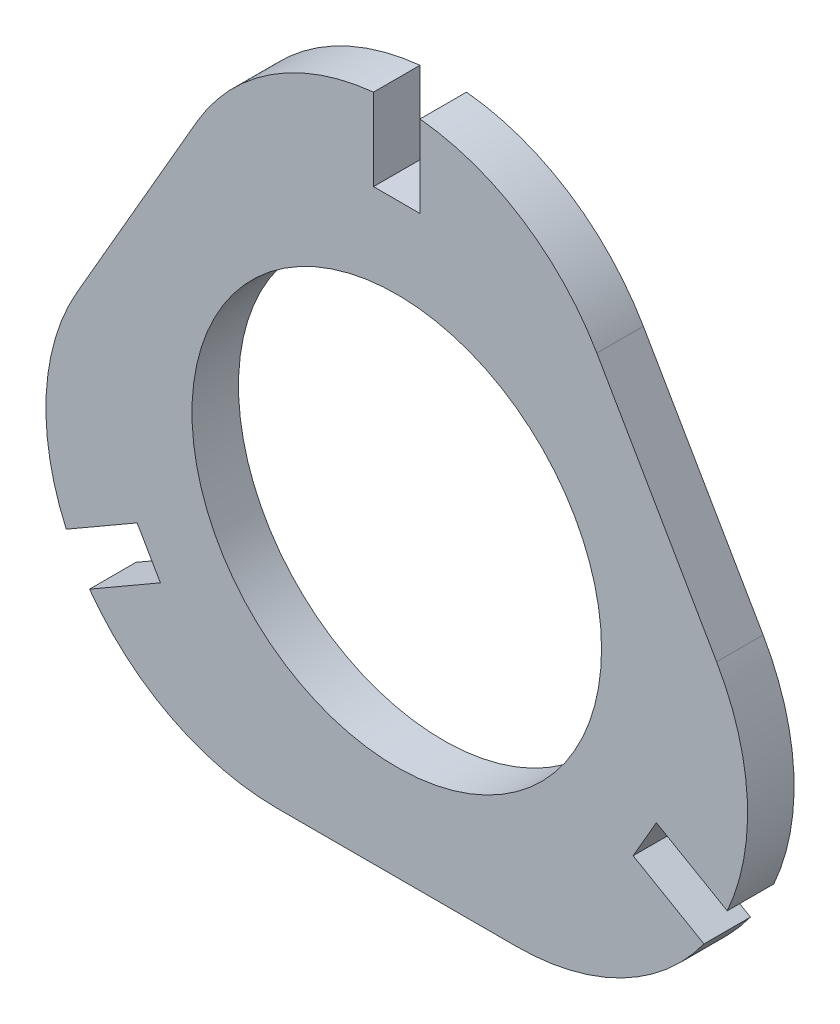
ISO-10303-21;
HEADER;
FILE_DESCRIPTION(('STEP AP214'),'2;1');
FILE_NAME('part.step','',(''),(''),'','','');
FILE_SCHEMA(('AUTOMOTIVE_DESIGN { 1 0 10303 214 1 1 1 1 }'));
ENDSEC;
DATA;
#1=APPLICATION_CONTEXT('core data for automotive mechanical design processes');
#2=APPLICATION_PROTOCOL_DEFINITION('international standard','automotive_design',2000,#1);
#3=PRODUCT_CONTEXT('',#1,'mechanical');
#4=PRODUCT('Part','Part','',(#3));
#5=PRODUCT_RELATED_PRODUCT_CATEGORY('part','',(#4));
#6=PRODUCT_DEFINITION_FORMATION('','',#4);
#7=PRODUCT_DEFINITION_CONTEXT('part definition',#1,'design');
#8=PRODUCT_DEFINITION('design','',#6,#7);
#9=PRODUCT_DEFINITION_SHAPE('','',#8);
#10=(LENGTH_UNIT() NAMED_UNIT(*) SI_UNIT(.MILLI.,.METRE.));
#11=(NAMED_UNIT(*) PLANE_ANGLE_UNIT() SI_UNIT($,.RADIAN.));
#12=(NAMED_UNIT(*) SI_UNIT($,.STERADIAN.) SOLID_ANGLE_UNIT());
#13=UNCERTAINTY_MEASURE_WITH_UNIT(LENGTH_MEASURE(1.E-05),#10,'distance_accuracy_value','');
#14=(GEOMETRIC_REPRESENTATION_CONTEXT(3) GLOBAL_UNCERTAINTY_ASSIGNED_CONTEXT((#13)) GLOBAL_UNIT_ASSIGNED_CONTEXT((#10,
#11,#12)) REPRESENTATION_CONTEXT('',''));
#15=CARTESIAN_POINT('',(0.,0.,0.));
#16=DIRECTION('',(0.,0.,1.));
#17=DIRECTION('',(1.,0.,0.));
#18=AXIS2_PLACEMENT_3D('',#15,#16,#17);
#19=CARTESIAN_POINT('',(-10.3034488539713,-5.94869896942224,0.));
#20=DIRECTION('',(0.,0.,1.));
#21=DIRECTION('',(1.,0.,0.));
#22=AXIS2_PLACEMENT_3D('',#19,#20,#21);
#23=CYLINDRICAL_SURFACE('',#22,19.875);
#24=DIRECTION('',(0.,0.,1.));
#25=VECTOR('',#24,1.);
#26=CARTESIAN_POINT('',(-26.4283348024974,-17.5678072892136,0.));
#27=LINE('',#26,#25);
#28=CARTESIAN_POINT('',(-26.4283348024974,-17.5678072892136,0.));
#29=VERTEX_POINT('',#28);
#30=CARTESIAN_POINT('',(-26.4283348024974,-17.5678072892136,4.));
#31=VERTEX_POINT('',#30);
#32=EDGE_CURVE('E354',#29,#31,#27,.T.);
#33=ORIENTED_EDGE('',*,*,#32,.F.);
#34=CARTESIAN_POINT('',(-10.3034488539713,-5.94869896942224,0.));
#35=DIRECTION('',(0.,0.,-1.));
#36=DIRECTION('',(-1.,0.,0.));
#37=AXIS2_PLACEMENT_3D('',#34,#35,#36);
#38=CIRCLE('',#37,19.875);
#39=CARTESIAN_POINT('',(-10.303448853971,-25.8236989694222,0.));
#40=VERTEX_POINT('',#39);
#41=EDGE_CURVE('E222',#29,#40,#38,.F.);
#42=ORIENTED_EDGE('',*,*,#41,.T.);
#43=DIRECTION('',(0.,0.,1.));
#44=VECTOR('',#43,1.);
#45=CARTESIAN_POINT('',(-10.303448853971,-25.8236989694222,0.));
#46=LINE('',#45,#44);
#47=CARTESIAN_POINT('',(-10.3034488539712,-25.8236989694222,4.));
#48=VERTEX_POINT('',#47);
#49=EDGE_CURVE('E218',#40,#48,#46,.T.);
#50=ORIENTED_EDGE('',*,*,#49,.T.);
#51=CARTESIAN_POINT('',(-10.3034488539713,-5.94869896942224,4.));
#52=DIRECTION('',(0.,0.,1.));
#53=DIRECTION('',(1.,0.,0.));
#54=AXIS2_PLACEMENT_3D('',#51,#52,#53);
#55=CIRCLE('',#54,19.875);
#56=EDGE_CURVE('E204',#31,#48,#55,.T.);
#57=ORIENTED_EDGE('',*,*,#56,.F.);
#58=EDGE_LOOP('',(#33,#42,#50,#57));
#59=FACE_BOUND('',#58,.T.);
#60=ADVANCED_FACE('F37',(#59),#23,.T.);
#61=CARTESIAN_POINT('',(10.3034488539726,-5.94869896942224,0.));
#62=DIRECTION('',(0.,0.,1.));
#63=DIRECTION('',(1.,0.,0.));
#64=AXIS2_PLACEMENT_3D('',#61,#62,#63);
#65=CYLINDRICAL_SURFACE('',#64,19.875);
#66=CARTESIAN_POINT('',(10.3034488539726,-5.94869896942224,4.));
#67=DIRECTION('',(0.,0.,1.));
#68=DIRECTION('',(1.,0.,0.));
#69=AXIS2_PLACEMENT_3D('',#66,#67,#68);
#70=CIRCLE('',#69,19.875);
#71=CARTESIAN_POINT('',(27.5157037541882,3.98880103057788,4.));
#72=VERTEX_POINT('',#71);
#73=CARTESIAN_POINT('',(28.4283348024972,-14.1037056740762,4.));
#74=VERTEX_POINT('',#73);
#75=EDGE_CURVE('E188',#72,#74,#70,.F.);
#76=ORIENTED_EDGE('',*,*,#75,.T.);
#77=DIRECTION('',(0.,0.,1.));
#78=VECTOR('',#77,1.);
#79=CARTESIAN_POINT('',(28.4283348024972,-14.1037056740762,0.));
#80=LINE('',#79,#78);
#81=CARTESIAN_POINT('',(28.4283348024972,-14.1037056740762,0.));
#82=VERTEX_POINT('',#81);
#83=EDGE_CURVE('E375',#82,#74,#80,.T.);
#84=ORIENTED_EDGE('',*,*,#83,.F.);
#85=CARTESIAN_POINT('',(10.3034488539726,-5.94869896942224,0.));
#86=DIRECTION('',(0.,0.,-1.));
#87=DIRECTION('',(-1.,0.,0.));
#88=AXIS2_PLACEMENT_3D('',#85,#86,#87);
#89=CIRCLE('',#88,19.875);
#90=CARTESIAN_POINT('',(27.5157037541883,3.98880103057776,0.));
#91=VERTEX_POINT('',#90);
#92=EDGE_CURVE('E212',#91,#82,#89,.T.);
#93=ORIENTED_EDGE('',*,*,#92,.F.);
#94=DIRECTION('',(0.,0.,1.));
#95=VECTOR('',#94,1.);
#96=CARTESIAN_POINT('',(27.5157037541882,3.988801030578,0.));
#97=LINE('',#96,#95);
#98=EDGE_CURVE('E192',#91,#72,#97,.T.);
#99=ORIENTED_EDGE('',*,*,#98,.T.);
#100=EDGE_LOOP('',(#76,#84,#93,#99));
#101=FACE_BOUND('',#100,.T.);
#102=ADVANCED_FACE('F311',(#101),#65,.T.);
#103=CARTESIAN_POINT('',(6.39169330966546E-13,11.8973979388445,0.));
#104=DIRECTION('',(0.,0.,1.));
#105=DIRECTION('',(1.,0.,0.));
#106=AXIS2_PLACEMENT_3D('',#103,#104,#105);
#107=CYLINDRICAL_SURFACE('',#106,19.875);
#108=DIRECTION('',(0.,0.,1.));
#109=VECTOR('',#108,1.);
#110=CARTESIAN_POINT('',(-2.,31.6715129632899,0.));
#111=LINE('',#110,#109);
#112=CARTESIAN_POINT('',(-2.,31.6715129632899,0.));
#113=VERTEX_POINT('',#112);
#114=CARTESIAN_POINT('',(-2.,31.6715129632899,4.));
#115=VERTEX_POINT('',#114);
#116=EDGE_CURVE('E255',#113,#115,#111,.T.);
#117=ORIENTED_EDGE('',*,*,#116,.F.);
#118=CARTESIAN_POINT('',(6.39169330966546E-13,11.8973979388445,0.));
#119=DIRECTION('',(0.,0.,-1.));
#120=DIRECTION('',(-1.,0.,0.));
#121=AXIS2_PLACEMENT_3D('',#118,#119,#120);
#122=CIRCLE('',#121,19.875);
#123=CARTESIAN_POINT('',(-17.2122549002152,21.8348979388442,0.));
#124=VERTEX_POINT('',#123);
#125=EDGE_CURVE('E237',#113,#124,#122,.F.);
#126=ORIENTED_EDGE('',*,*,#125,.T.);
#127=DIRECTION('',(0.,0.,1.));
#128=VECTOR('',#127,1.);
#129=CARTESIAN_POINT('',(-17.2122549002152,21.8348979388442,0.));
#130=LINE('',#129,#128);
#131=CARTESIAN_POINT('',(-17.2122549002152,21.8348979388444,4.));
#132=VERTEX_POINT('',#131);
#133=EDGE_CURVE('E233',#124,#132,#130,.T.);
#134=ORIENTED_EDGE('',*,*,#133,.T.);
#135=CARTESIAN_POINT('',(6.39169330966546E-13,11.8973979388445,4.));
#136=DIRECTION('',(0.,0.,1.));
#137=DIRECTION('',(1.,0.,0.));
#138=AXIS2_PLACEMENT_3D('',#135,#136,#137);
#139=CIRCLE('',#138,19.875);
#140=EDGE_CURVE('E208',#115,#132,#139,.T.);
#141=ORIENTED_EDGE('',*,*,#140,.F.);
#142=EDGE_LOOP('',(#117,#126,#134,#141));
#143=FACE_BOUND('',#142,.T.);
#144=ADVANCED_FACE('F279',(#143),#107,.T.);
#145=CARTESIAN_POINT('',(0.,0.,0.));
#146=DIRECTION('',(0.,0.,1.));
#147=DIRECTION('',(1.,0.,0.));
#148=AXIS2_PLACEMENT_3D('',#145,#146,#147);
#149=PLANE('',#148);
#150=CARTESIAN_POINT('',(0.,0.,0.));
#151=DIRECTION('',(0.,0.,1.));
#152=DIRECTION('',(1.,0.,0.));
#153=AXIS2_PLACEMENT_3D('',#150,#151,#152);
#154=CIRCLE('',#153,17.6153656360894);
#155=CARTESIAN_POINT('',(17.6153656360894,0.,0.));
#156=VERTEX_POINT('',#155);
#157=EDGE_CURVE('E236',#156,#156,#154,.T.);
#158=ORIENTED_EDGE('',*,*,#157,.T.);
#159=EDGE_LOOP('',(#158));
#160=FACE_BOUND('',#159,.T.);
#161=ORIENTED_EDGE('',*,*,#92,.T.);
#162=DIRECTION('',(-0.866025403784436,0.500000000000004,0.));
#163=VECTOR('',#162,1.);
#164=CARTESIAN_POINT('',(1.00000000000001,1.73205080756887,0.));
#165=LINE('',#164,#163);
#166=CARTESIAN_POINT('',(22.3314023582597,-10.5836400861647,0.));
#167=VERTEX_POINT('',#166);
#168=EDGE_CURVE('E282',#82,#167,#165,.T.);
#169=ORIENTED_EDGE('',*,*,#168,.T.);
#170=DIRECTION('',(-0.500000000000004,-0.866025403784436,0.));
#171=VECTOR('',#170,1.);
#172=CARTESIAN_POINT('',(21.3314023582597,-12.3156908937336,0.));
#173=LINE('',#172,#171);
#174=CARTESIAN_POINT('',(20.3314023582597,-14.0477417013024,0.));
#175=VERTEX_POINT('',#174);
#176=EDGE_CURVE('E367',#167,#175,#173,.T.);
#177=ORIENTED_EDGE('',*,*,#176,.T.);
#178=DIRECTION('',(0.866025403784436,-0.500000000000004,0.));
#179=VECTOR('',#178,1.);
#180=CARTESIAN_POINT('',(-1.00000000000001,-1.73205080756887,0.));
#181=LINE('',#180,#179);
#182=CARTESIAN_POINT('',(26.4283348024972,-17.567807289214,0.));
#183=VERTEX_POINT('',#182);
#184=EDGE_CURVE('E180',#175,#183,#181,.T.);
#185=ORIENTED_EDGE('',*,*,#184,.T.);
#186=CARTESIAN_POINT('',(10.3034488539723,-25.8236989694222,0.));
#187=VERTEX_POINT('',#186);
#188=EDGE_CURVE('E179',#183,#187,#89,.T.);
#189=ORIENTED_EDGE('',*,*,#188,.T.);
#190=DIRECTION('',(1.,0.,0.));
#191=VECTOR('',#190,1.);
#192=CARTESIAN_POINT('',(10.3034488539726,-25.8236989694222,0.));
#193=LINE('',#192,#191);
#194=EDGE_CURVE('E193',#40,#187,#193,.T.);
#195=ORIENTED_EDGE('',*,*,#194,.F.);
#196=ORIENTED_EDGE('',*,*,#41,.F.);
#197=DIRECTION('',(0.866025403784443,0.499999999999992,0.));
#198=VECTOR('',#197,1.);
#199=CARTESIAN_POINT('',(0.999999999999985,-1.73205080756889,0.));
#200=LINE('',#199,#198);
#201=CARTESIAN_POINT('',(-20.3314023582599,-14.0477417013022,0.));
#202=VERTEX_POINT('',#201);
#203=EDGE_CURVE('E171',#29,#202,#200,.T.);
#204=ORIENTED_EDGE('',*,*,#203,.T.);
#205=DIRECTION('',(-0.499999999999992,0.866025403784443,0.));
#206=VECTOR('',#205,1.);
#207=CARTESIAN_POINT('',(-21.3314023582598,-12.3156908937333,0.));
#208=LINE('',#207,#206);
#209=CARTESIAN_POINT('',(-22.3314023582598,-10.5836400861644,0.));
#210=VERTEX_POINT('',#209);
#211=EDGE_CURVE('E351',#202,#210,#208,.T.);
#212=ORIENTED_EDGE('',*,*,#211,.T.);
#213=DIRECTION('',(-0.866025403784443,-0.499999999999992,0.));
#214=VECTOR('',#213,1.);
#215=CARTESIAN_POINT('',(-0.999999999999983,1.73205080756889,0.));
#216=LINE('',#215,#214);
#217=CARTESIAN_POINT('',(-28.4283348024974,-14.1037056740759,0.));
#218=VERTEX_POINT('',#217);
#219=EDGE_CURVE('E337',#210,#218,#216,.T.);
#220=ORIENTED_EDGE('',*,*,#219,.T.);
#221=CARTESIAN_POINT('',(-27.5157037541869,3.988801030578,0.));
#222=VERTEX_POINT('',#221);
#223=EDGE_CURVE('E219',#222,#218,#38,.F.);
#224=ORIENTED_EDGE('',*,*,#223,.F.);
#225=DIRECTION('',(-0.5,-0.866025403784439,0.));
#226=VECTOR('',#225,1.);
#227=CARTESIAN_POINT('',(-22.3639793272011,12.9118494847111,0.));
#228=LINE('',#227,#226);
#229=EDGE_CURVE('E223',#124,#222,#228,.T.);
#230=ORIENTED_EDGE('',*,*,#229,.F.);
#231=ORIENTED_EDGE('',*,*,#125,.F.);
#232=DIRECTION('',(0.,-1.,0.));
#233=VECTOR('',#232,1.);
#234=CARTESIAN_POINT('',(-2.,0.,0.));
#235=LINE('',#234,#233);
#236=CARTESIAN_POINT('',(-2.,24.6313817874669,0.));
#237=VERTEX_POINT('',#236);
#238=EDGE_CURVE('E244',#113,#237,#235,.T.);
#239=ORIENTED_EDGE('',*,*,#238,.T.);
#240=DIRECTION('',(1.,0.,0.));
#241=VECTOR('',#240,1.);
#242=CARTESIAN_POINT('',(0.,24.6313817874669,0.));
#243=LINE('',#242,#241);
#244=CARTESIAN_POINT('',(2.,24.6313817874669,0.));
#245=VERTEX_POINT('',#244);
#246=EDGE_CURVE('E249',#237,#245,#243,.T.);
#247=ORIENTED_EDGE('',*,*,#246,.T.);
#248=DIRECTION('',(0.,1.,0.));
#249=VECTOR('',#248,1.);
#250=CARTESIAN_POINT('',(2.,0.,0.));
#251=LINE('',#250,#249);
#252=CARTESIAN_POINT('',(2.,31.67151296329,0.));
#253=VERTEX_POINT('',#252);
#254=EDGE_CURVE('E252',#245,#253,#251,.T.);
#255=ORIENTED_EDGE('',*,*,#254,.T.);
#256=CARTESIAN_POINT('',(17.2122549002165,21.8348979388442,0.));
#257=VERTEX_POINT('',#256);
#258=EDGE_CURVE('E41',#257,#253,#122,.F.);
#259=ORIENTED_EDGE('',*,*,#258,.F.);
#260=DIRECTION('',(-0.5,0.866025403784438,0.));
#261=VECTOR('',#260,1.);
#262=CARTESIAN_POINT('',(27.5157037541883,3.98880103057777,0.));
#263=LINE('',#262,#261);
#264=EDGE_CURVE('E215',#91,#257,#263,.T.);
#265=ORIENTED_EDGE('',*,*,#264,.F.);
#266=EDGE_LOOP('',(#161,#169,#177,#185,#189,#195,#196,#204,#212,#220,#224,#230,#231,#239,#247,
#255,#259,#265));
#267=FACE_BOUND('',#266,.T.);
#268=ADVANCED_FACE('F39',(#160,#267),#149,.F.);
#269=CARTESIAN_POINT('',(27.5157037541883,3.98880103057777,0.));
#270=DIRECTION('',(0.866025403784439,0.5,0.));
#271=DIRECTION('',(-0.5,0.866025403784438,0.));
#272=AXIS2_PLACEMENT_3D('',#269,#270,#271);
#273=PLANE('',#272);
#274=ORIENTED_EDGE('',*,*,#98,.F.);
#275=ORIENTED_EDGE('',*,*,#264,.T.);
#276=DIRECTION('',(0.,0.,1.));
#277=VECTOR('',#276,1.);
#278=CARTESIAN_POINT('',(17.2122549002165,21.8348979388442,0.));
#279=LINE('',#278,#277);
#280=CARTESIAN_POINT('',(17.2122549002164,21.8348979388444,4.));
#281=VERTEX_POINT('',#280);
#282=EDGE_CURVE('E229',#257,#281,#279,.T.);
#283=ORIENTED_EDGE('',*,*,#282,.T.);
#284=DIRECTION('',(-0.5,0.866025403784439,0.));
#285=VECTOR('',#284,1.);
#286=CARTESIAN_POINT('',(27.5157037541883,3.98880103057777,4.));
#287=LINE('',#286,#285);
#288=EDGE_CURVE('E200',#72,#281,#287,.T.);
#289=ORIENTED_EDGE('',*,*,#288,.F.);
#290=EDGE_LOOP('',(#274,#275,#283,#289));
#291=FACE_BOUND('',#290,.T.);
#292=ADVANCED_FACE('F383',(#291),#273,.T.);
#293=DIRECTION('',(0.,0.,1.));
#294=VECTOR('',#293,1.);
#295=CARTESIAN_POINT('',(2.,31.67151296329,0.));
#296=LINE('',#295,#294);
#297=CARTESIAN_POINT('',(2.,31.67151296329,4.));
#298=VERTEX_POINT('',#297);
#299=EDGE_CURVE('E11',#298,#253,#296,.F.);
#300=ORIENTED_EDGE('',*,*,#299,.F.);
#301=EDGE_CURVE('E211',#281,#298,#139,.T.);
#302=ORIENTED_EDGE('',*,*,#301,.F.);
#303=ORIENTED_EDGE('',*,*,#282,.F.);
#304=ORIENTED_EDGE('',*,*,#258,.T.);
#305=EDGE_LOOP('',(#300,#302,#303,#304));
#306=FACE_BOUND('',#305,.T.);
#307=ADVANCED_FACE('F290',(#306),#107,.T.);
#308=CARTESIAN_POINT('',(-22.3639793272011,12.9118494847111,0.));
#309=DIRECTION('',(-0.866025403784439,0.5,0.));
#310=DIRECTION('',(-0.5,-0.866025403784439,0.));
#311=AXIS2_PLACEMENT_3D('',#308,#309,#310);
#312=PLANE('',#311);
#313=ORIENTED_EDGE('',*,*,#133,.F.);
#314=ORIENTED_EDGE('',*,*,#229,.T.);
#315=DIRECTION('',(0.,0.,1.));
#316=VECTOR('',#315,1.);
#317=CARTESIAN_POINT('',(-27.5157037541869,3.988801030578,0.));
#318=LINE('',#317,#316);
#319=CARTESIAN_POINT('',(-27.515703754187,3.98880103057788,4.));
#320=VERTEX_POINT('',#319);
#321=EDGE_CURVE('E226',#222,#320,#318,.T.);
#322=ORIENTED_EDGE('',*,*,#321,.T.);
#323=DIRECTION('',(-0.5,-0.866025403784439,0.));
#324=VECTOR('',#323,1.);
#325=CARTESIAN_POINT('',(-17.2122549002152,21.8348979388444,4.));
#326=LINE('',#325,#324);
#327=EDGE_CURVE('E205',#132,#320,#326,.T.);
#328=ORIENTED_EDGE('',*,*,#327,.F.);
#329=EDGE_LOOP('',(#313,#314,#322,#328));
#330=FACE_BOUND('',#329,.T.);
#331=ADVANCED_FACE('F277',(#330),#312,.T.);
#332=DIRECTION('',(0.,0.,1.));
#333=VECTOR('',#332,1.);
#334=CARTESIAN_POINT('',(-28.4283348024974,-14.1037056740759,0.));
#335=LINE('',#334,#333);
#336=CARTESIAN_POINT('',(-28.4283348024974,-14.1037056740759,4.));
#337=VERTEX_POINT('',#336);
#338=EDGE_CURVE('E332',#337,#218,#335,.F.);
#339=ORIENTED_EDGE('',*,*,#338,.F.);
#340=EDGE_CURVE('E201',#320,#337,#55,.T.);
#341=ORIENTED_EDGE('',*,*,#340,.F.);
#342=ORIENTED_EDGE('',*,*,#321,.F.);
#343=ORIENTED_EDGE('',*,*,#223,.T.);
#344=EDGE_LOOP('',(#339,#341,#342,#343));
#345=FACE_BOUND('',#344,.T.);
#346=ADVANCED_FACE('F314',(#345),#23,.T.);
#347=CARTESIAN_POINT('',(10.3034488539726,-25.8236989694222,0.));
#348=DIRECTION('',(0.,-1.,0.));
#349=DIRECTION('',(0.,0.,-1.));
#350=AXIS2_PLACEMENT_3D('',#347,#348,#349);
#351=PLANE('',#350);
#352=ORIENTED_EDGE('',*,*,#49,.F.);
#353=ORIENTED_EDGE('',*,*,#194,.T.);
#354=DIRECTION('',(0.,0.,1.));
#355=VECTOR('',#354,1.);
#356=CARTESIAN_POINT('',(10.3034488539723,-25.8236989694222,0.));
#357=LINE('',#356,#355);
#358=CARTESIAN_POINT('',(10.3034488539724,-25.8236989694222,4.));
#359=VERTEX_POINT('',#358);
#360=EDGE_CURVE('E189',#187,#359,#357,.T.);
#361=ORIENTED_EDGE('',*,*,#360,.T.);
#362=DIRECTION('',(1.,0.,0.));
#363=VECTOR('',#362,1.);
#364=CARTESIAN_POINT('',(0.,-25.8236989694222,4.));
#365=LINE('',#364,#363);
#366=EDGE_CURVE('E187',#48,#359,#365,.T.);
#367=ORIENTED_EDGE('',*,*,#366,.F.);
#368=EDGE_LOOP('',(#352,#353,#361,#367));
#369=FACE_BOUND('',#368,.T.);
#370=ADVANCED_FACE('F324',(#369),#351,.T.);
#371=ORIENTED_EDGE('',*,*,#188,.F.);
#372=DIRECTION('',(0.,0.,1.));
#373=VECTOR('',#372,1.);
#374=CARTESIAN_POINT('',(26.4283348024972,-17.567807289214,0.));
#375=LINE('',#374,#373);
#376=CARTESIAN_POINT('',(26.4283348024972,-17.567807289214,4.));
#377=VERTEX_POINT('',#376);
#378=EDGE_CURVE('E166',#377,#183,#375,.F.);
#379=ORIENTED_EDGE('',*,*,#378,.F.);
#380=EDGE_CURVE('E177',#377,#359,#70,.F.);
#381=ORIENTED_EDGE('',*,*,#380,.T.);
#382=ORIENTED_EDGE('',*,*,#360,.F.);
#383=EDGE_LOOP('',(#371,#379,#381,#382));
#384=FACE_BOUND('',#383,.T.);
#385=ADVANCED_FACE('F175',(#384),#65,.T.);
#386=CARTESIAN_POINT('',(0.,0.,4.));
#387=DIRECTION('',(0.,0.,1.));
#388=DIRECTION('',(1.,0.,0.));
#389=AXIS2_PLACEMENT_3D('',#386,#387,#388);
#390=PLANE('',#389);
#391=DIRECTION('',(-0.866025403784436,0.500000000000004,0.));
#392=VECTOR('',#391,1.);
#393=CARTESIAN_POINT('',(1.00000000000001,1.73205080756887,4.));
#394=LINE('',#393,#392);
#395=CARTESIAN_POINT('',(22.3314023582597,-10.5836400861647,4.));
#396=VERTEX_POINT('',#395);
#397=EDGE_CURVE('E284',#74,#396,#394,.T.);
#398=ORIENTED_EDGE('',*,*,#397,.F.);
#399=ORIENTED_EDGE('',*,*,#75,.F.);
#400=ORIENTED_EDGE('',*,*,#288,.T.);
#401=ORIENTED_EDGE('',*,*,#301,.T.);
#402=DIRECTION('',(0.,1.,0.));
#403=VECTOR('',#402,1.);
#404=CARTESIAN_POINT('',(2.,0.,4.));
#405=LINE('',#404,#403);
#406=CARTESIAN_POINT('',(2.,24.6313817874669,4.));
#407=VERTEX_POINT('',#406);
#408=EDGE_CURVE('E46',#407,#298,#405,.T.);
#409=ORIENTED_EDGE('',*,*,#408,.F.);
#410=DIRECTION('',(1.,0.,0.));
#411=VECTOR('',#410,1.);
#412=CARTESIAN_POINT('',(0.,24.6313817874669,4.));
#413=LINE('',#412,#411);
#414=CARTESIAN_POINT('',(-2.,24.6313817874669,4.));
#415=VERTEX_POINT('',#414);
#416=EDGE_CURVE('E257',#415,#407,#413,.T.);
#417=ORIENTED_EDGE('',*,*,#416,.F.);
#418=DIRECTION('',(0.,-1.,0.));
#419=VECTOR('',#418,1.);
#420=CARTESIAN_POINT('',(-2.,0.,4.));
#421=LINE('',#420,#419);
#422=EDGE_CURVE('E197',#115,#415,#421,.T.);
#423=ORIENTED_EDGE('',*,*,#422,.F.);
#424=ORIENTED_EDGE('',*,*,#140,.T.);
#425=ORIENTED_EDGE('',*,*,#327,.T.);
#426=ORIENTED_EDGE('',*,*,#340,.T.);
#427=DIRECTION('',(-0.866025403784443,-0.499999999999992,0.));
#428=VECTOR('',#427,1.);
#429=CARTESIAN_POINT('',(-0.999999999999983,1.73205080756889,4.));
#430=LINE('',#429,#428);
#431=CARTESIAN_POINT('',(-22.3314023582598,-10.5836400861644,4.));
#432=VERTEX_POINT('',#431);
#433=EDGE_CURVE('E341',#432,#337,#430,.T.);
#434=ORIENTED_EDGE('',*,*,#433,.F.);
#435=DIRECTION('',(-0.499999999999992,0.866025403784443,0.));
#436=VECTOR('',#435,1.);
#437=CARTESIAN_POINT('',(-21.3314023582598,-12.3156908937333,4.));
#438=LINE('',#437,#436);
#439=CARTESIAN_POINT('',(-20.3314023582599,-14.0477417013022,4.));
#440=VERTEX_POINT('',#439);
#441=EDGE_CURVE('E62',#440,#432,#438,.T.);
#442=ORIENTED_EDGE('',*,*,#441,.F.);
#443=DIRECTION('',(0.866025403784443,0.499999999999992,0.));
#444=VECTOR('',#443,1.);
#445=CARTESIAN_POINT('',(0.999999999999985,-1.73205080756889,4.));
#446=LINE('',#445,#444);
#447=EDGE_CURVE('E356',#31,#440,#446,.T.);
#448=ORIENTED_EDGE('',*,*,#447,.F.);
#449=ORIENTED_EDGE('',*,*,#56,.T.);
#450=ORIENTED_EDGE('',*,*,#366,.T.);
#451=ORIENTED_EDGE('',*,*,#380,.F.);
#452=DIRECTION('',(0.866025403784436,-0.500000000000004,0.));
#453=VECTOR('',#452,1.);
#454=CARTESIAN_POINT('',(-1.00000000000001,-1.73205080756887,4.));
#455=LINE('',#454,#453);
#456=CARTESIAN_POINT('',(20.3314023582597,-14.0477417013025,4.));
#457=VERTEX_POINT('',#456);
#458=EDGE_CURVE('E162',#457,#377,#455,.T.);
#459=ORIENTED_EDGE('',*,*,#458,.F.);
#460=DIRECTION('',(-0.500000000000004,-0.866025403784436,0.));
#461=VECTOR('',#460,1.);
#462=CARTESIAN_POINT('',(21.3314023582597,-12.3156908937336,4.));
#463=LINE('',#462,#461);
#464=EDGE_CURVE('E54',#396,#457,#463,.T.);
#465=ORIENTED_EDGE('',*,*,#464,.F.);
#466=EDGE_LOOP('',(#398,#399,#400,#401,#409,#417,#423,#424,#425,#426,#434,#442,#448,#449,#450,
#451,#459,#465));
#467=FACE_BOUND('',#466,.T.);
#468=CARTESIAN_POINT('',(0.,0.,4.));
#469=DIRECTION('',(0.,0.,1.));
#470=DIRECTION('',(1.,0.,0.));
#471=AXIS2_PLACEMENT_3D('',#468,#469,#470);
#472=CIRCLE('',#471,17.6153656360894);
#473=CARTESIAN_POINT('',(17.6153656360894,0.,4.));
#474=VERTEX_POINT('',#473);
#475=EDGE_CURVE('E245',#474,#474,#472,.T.);
#476=ORIENTED_EDGE('',*,*,#475,.F.);
#477=EDGE_LOOP('',(#476));
#478=FACE_BOUND('',#477,.T.);
#479=ADVANCED_FACE('F184',(#467,#478),#390,.T.);
#480=CARTESIAN_POINT('',(0.,0.,-6.));
#481=DIRECTION('',(0.,0.,1.));
#482=DIRECTION('',(1.,0.,0.));
#483=AXIS2_PLACEMENT_3D('',#480,#481,#482);
#484=CYLINDRICAL_SURFACE('',#483,17.6153656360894);
#485=ORIENTED_EDGE('',*,*,#475,.T.);
#486=EDGE_LOOP('',(#485));
#487=FACE_BOUND('',#486,.T.);
#488=ORIENTED_EDGE('',*,*,#157,.F.);
#489=EDGE_LOOP('',(#488));
#490=FACE_BOUND('',#489,.T.);
#491=ADVANCED_FACE('F308',(#487,#490),#484,.F.);
#492=CARTESIAN_POINT('',(0.,24.6313817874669,-6.));
#493=DIRECTION('',(0.,-1.,0.));
#494=DIRECTION('',(0.,0.,-1.));
#495=AXIS2_PLACEMENT_3D('',#492,#493,#494);
#496=PLANE('',#495);
#497=DIRECTION('',(0.,0.,1.));
#498=VECTOR('',#497,1.);
#499=CARTESIAN_POINT('',(-2.,24.6313817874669,-6.));
#500=LINE('',#499,#498);
#501=EDGE_CURVE('E248',#237,#415,#500,.T.);
#502=ORIENTED_EDGE('',*,*,#501,.T.);
#503=ORIENTED_EDGE('',*,*,#416,.T.);
#504=DIRECTION('',(0.,0.,1.));
#505=VECTOR('',#504,1.);
#506=CARTESIAN_POINT('',(2.,24.6313817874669,-6.));
#507=LINE('',#506,#505);
#508=EDGE_CURVE('E261',#245,#407,#507,.T.);
#509=ORIENTED_EDGE('',*,*,#508,.F.);
#510=ORIENTED_EDGE('',*,*,#246,.F.);
#511=EDGE_LOOP('',(#502,#503,#509,#510));
#512=FACE_BOUND('',#511,.T.);
#513=ADVANCED_FACE('F296',(#512),#496,.F.);
#514=CARTESIAN_POINT('',(-2.,0.,-6.));
#515=DIRECTION('',(-1.,0.,0.));
#516=DIRECTION('',(0.,-1.,0.));
#517=AXIS2_PLACEMENT_3D('',#514,#515,#516);
#518=PLANE('',#517);
#519=ORIENTED_EDGE('',*,*,#116,.T.);
#520=ORIENTED_EDGE('',*,*,#422,.T.);
#521=ORIENTED_EDGE('',*,*,#501,.F.);
#522=ORIENTED_EDGE('',*,*,#238,.F.);
#523=EDGE_LOOP('',(#519,#520,#521,#522));
#524=FACE_BOUND('',#523,.T.);
#525=ADVANCED_FACE('F299',(#524),#518,.F.);
#526=CARTESIAN_POINT('',(2.,0.,-6.));
#527=DIRECTION('',(1.,0.,0.));
#528=DIRECTION('',(0.,1.,0.));
#529=AXIS2_PLACEMENT_3D('',#526,#527,#528);
#530=PLANE('',#529);
#531=ORIENTED_EDGE('',*,*,#508,.T.);
#532=ORIENTED_EDGE('',*,*,#408,.T.);
#533=ORIENTED_EDGE('',*,*,#299,.T.);
#534=ORIENTED_EDGE('',*,*,#254,.F.);
#535=EDGE_LOOP('',(#531,#532,#533,#534));
#536=FACE_BOUND('',#535,.T.);
#537=ADVANCED_FACE('F294',(#536),#530,.F.);
#538=CARTESIAN_POINT('',(0.999999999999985,-1.73205080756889,-6.));
#539=DIRECTION('',(0.499999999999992,-0.866025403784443,0.));
#540=DIRECTION('',(0.866025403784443,0.499999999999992,0.));
#541=AXIS2_PLACEMENT_3D('',#538,#539,#540);
#542=PLANE('',#541);
#543=ORIENTED_EDGE('',*,*,#32,.T.);
#544=ORIENTED_EDGE('',*,*,#447,.T.);
#545=DIRECTION('',(0.,0.,1.));
#546=VECTOR('',#545,1.);
#547=CARTESIAN_POINT('',(-20.3314023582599,-14.0477417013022,-6.));
#548=LINE('',#547,#546);
#549=EDGE_CURVE('E348',#202,#440,#548,.T.);
#550=ORIENTED_EDGE('',*,*,#549,.F.);
#551=ORIENTED_EDGE('',*,*,#203,.F.);
#552=EDGE_LOOP('',(#543,#544,#550,#551));
#553=FACE_BOUND('',#552,.T.);
#554=ADVANCED_FACE('F306',(#553),#542,.F.);
#555=CARTESIAN_POINT('',(-21.3314023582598,-12.3156908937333,-6.));
#556=DIRECTION('',(0.866025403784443,0.499999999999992,0.));
#557=DIRECTION('',(0.,0.,-1.));
#558=AXIS2_PLACEMENT_3D('',#555,#556,#557);
#559=PLANE('',#558);
#560=ORIENTED_EDGE('',*,*,#549,.T.);
#561=ORIENTED_EDGE('',*,*,#441,.T.);
#562=DIRECTION('',(0.,0.,1.));
#563=VECTOR('',#562,1.);
#564=CARTESIAN_POINT('',(-22.3314023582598,-10.5836400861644,-6.));
#565=LINE('',#564,#563);
#566=EDGE_CURVE('E338',#210,#432,#565,.T.);
#567=ORIENTED_EDGE('',*,*,#566,.F.);
#568=ORIENTED_EDGE('',*,*,#211,.F.);
#569=EDGE_LOOP('',(#560,#561,#567,#568));
#570=FACE_BOUND('',#569,.T.);
#571=ADVANCED_FACE('F394',(#570),#559,.F.);
#572=CARTESIAN_POINT('',(-0.999999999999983,1.73205080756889,-6.));
#573=DIRECTION('',(-0.499999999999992,0.866025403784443,0.));
#574=DIRECTION('',(-0.866025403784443,-0.499999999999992,0.));
#575=AXIS2_PLACEMENT_3D('',#572,#573,#574);
#576=PLANE('',#575);
#577=ORIENTED_EDGE('',*,*,#566,.T.);
#578=ORIENTED_EDGE('',*,*,#433,.T.);
#579=ORIENTED_EDGE('',*,*,#338,.T.);
#580=ORIENTED_EDGE('',*,*,#219,.F.);
#581=EDGE_LOOP('',(#577,#578,#579,#580));
#582=FACE_BOUND('',#581,.T.);
#583=ADVANCED_FACE('F397',(#582),#576,.F.);
#584=CARTESIAN_POINT('',(1.00000000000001,1.73205080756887,-6.));
#585=DIRECTION('',(0.500000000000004,0.866025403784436,0.));
#586=DIRECTION('',(-0.866025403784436,0.500000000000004,0.));
#587=AXIS2_PLACEMENT_3D('',#584,#585,#586);
#588=PLANE('',#587);
#589=ORIENTED_EDGE('',*,*,#83,.T.);
#590=ORIENTED_EDGE('',*,*,#397,.T.);
#591=DIRECTION('',(0.,0.,1.));
#592=VECTOR('',#591,1.);
#593=CARTESIAN_POINT('',(22.3314023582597,-10.5836400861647,-6.));
#594=LINE('',#593,#592);
#595=EDGE_CURVE('E368',#167,#396,#594,.T.);
#596=ORIENTED_EDGE('',*,*,#595,.F.);
#597=ORIENTED_EDGE('',*,*,#168,.F.);
#598=EDGE_LOOP('',(#589,#590,#596,#597));
#599=FACE_BOUND('',#598,.T.);
#600=ADVANCED_FACE('F378',(#599),#588,.F.);
#601=CARTESIAN_POINT('',(21.3314023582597,-12.3156908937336,-6.));
#602=DIRECTION('',(-0.866025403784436,0.500000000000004,0.));
#603=DIRECTION('',(0.,0.,-1.));
#604=AXIS2_PLACEMENT_3D('',#601,#602,#603);
#605=PLANE('',#604);
#606=ORIENTED_EDGE('',*,*,#595,.T.);
#607=ORIENTED_EDGE('',*,*,#464,.T.);
#608=DIRECTION('',(0.,0.,1.));
#609=VECTOR('',#608,1.);
#610=CARTESIAN_POINT('',(20.3314023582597,-14.0477417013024,-6.));
#611=LINE('',#610,#609);
#612=EDGE_CURVE('E168',#175,#457,#611,.T.);
#613=ORIENTED_EDGE('',*,*,#612,.F.);
#614=ORIENTED_EDGE('',*,*,#176,.F.);
#615=EDGE_LOOP('',(#606,#607,#613,#614));
#616=FACE_BOUND('',#615,.T.);
#617=ADVANCED_FACE('F402',(#616),#605,.F.);
#618=CARTESIAN_POINT('',(-1.00000000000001,-1.73205080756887,-6.));
#619=DIRECTION('',(-0.500000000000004,-0.866025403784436,0.));
#620=DIRECTION('',(0.866025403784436,-0.500000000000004,0.));
#621=AXIS2_PLACEMENT_3D('',#618,#619,#620);
#622=PLANE('',#621);
#623=ORIENTED_EDGE('',*,*,#612,.T.);
#624=ORIENTED_EDGE('',*,*,#458,.T.);
#625=ORIENTED_EDGE('',*,*,#378,.T.);
#626=ORIENTED_EDGE('',*,*,#184,.F.);
#627=EDGE_LOOP('',(#623,#624,#625,#626));
#628=FACE_BOUND('',#627,.T.);
#629=ADVANCED_FACE('F164',(#628),#622,.F.);
#630=CLOSED_SHELL('',(#60,#102,#144,#268,#292,#307,#331,#346,#370,#385,#479,#491,#513,#525,#537,
#554,#571,#583,#600,#617,#629));
#631=MANIFOLD_SOLID_BREP('B2',#630);
#632=ADVANCED_BREP_SHAPE_REPRESENTATION('',(#18,#631),#14);
#633=SHAPE_DEFINITION_REPRESENTATION(#9,#632);
ENDSEC;
END-ISO-10303-21;
